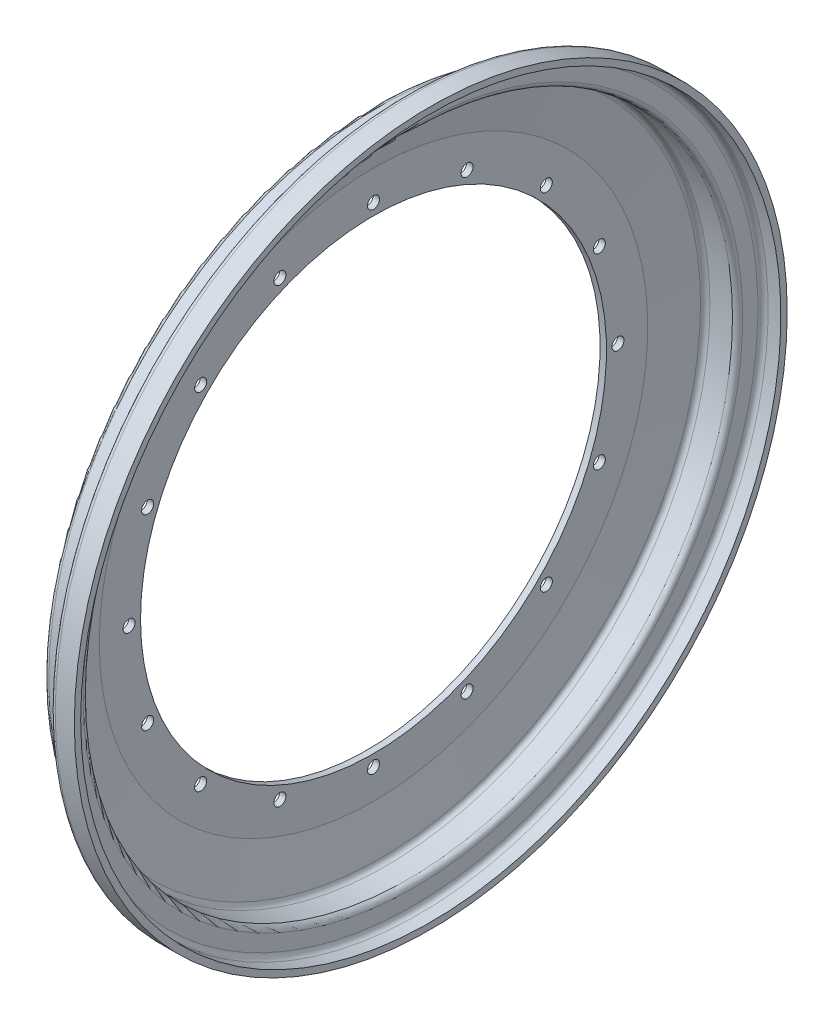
from build123d import *

# Parameters (mm, degrees)
F_6_0_6_DIAMETER_HOLE1_D = 6
CIRPATTERN1_COUNT        = 16


with BuildPart() as part:
    # Sketch1 → Base-Revolve (revolve)
    with BuildSketch(Plane.XY, mode=Mode.PRIVATE) as base_revolve_sk:
        with BuildLine():
            Line((0, 116.205), (0, 136.779))
            Line((0, 136.779), (3.836908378, 162.928741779))
            ThreePointArc((3.836908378, 162.928741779), (4.689428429, 164.482004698), (6.35, 165.1))
            Line((6.35, 165.1), (17.145, 165.1))
            ThreePointArc((17.145, 165.1), (18.941051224, 165.843948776), (19.685, 167.64))
            Line((19.685, 167.64), (19.685, 175.26))
            ThreePointArc((19.685, 175.26), (20.428948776, 177.056051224), (22.225, 177.8))
            Line((22.225, 177.8), (31.75, 177.8))
            Line((31.75, 177.8), (31.75, 174.625))
            Line((31.75, 174.625), (25.4, 174.625))
            ThreePointArc((25.4, 174.625), (23.603948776, 173.881051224), (22.86, 172.085))
            Line((22.86, 172.085), (22.86, 164.465))
            ThreePointArc((22.86, 164.465), (22.116051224, 162.668948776), (20.32, 161.925))
            Line((20.32, 161.925), (9.059137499, 161.925))
            ThreePointArc((9.059137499, 161.925), (7.398565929, 161.307004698), (6.546045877, 159.753741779))
            Line((6.546045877, 159.753741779), (3.175, 136.779))
            Line((3.175, 136.779), (3.175, 116.205))
            Line((3.175, 116.205), (0, 116.205))
        make_face()
    revolve(base_revolve_sk.sketch.rotate(Axis((0, 0, 0), (1, 0, 0)), 90), axis=Axis((0, 0, 0), (1, 0, 0)))

    # 6.0 _6_ Diameter Hole1 (through all)
    with Locations(Plane(origin=(3.175, 0, 0), x_dir=(0, 0, -1), z_dir=(1, 0, 0))):
        with Locations((0, 121.92)):
            f_6_0_6_diameter_hole1 = Hole(F_6_0_6_DIAMETER_HOLE1_D / 2)

    # CirPattern1: 6.0 _6_ Diameter Hole1 ×16 about axis
    cirpattern1_axis = Axis((0, 0, 0), (1, 0, 0))
    for i in range(1, CIRPATTERN1_COUNT):
        add(f_6_0_6_diameter_hole1.rotate(cirpattern1_axis, i * 360 / CIRPATTERN1_COUNT), mode=Mode.SUBTRACT)


solid = part.part
